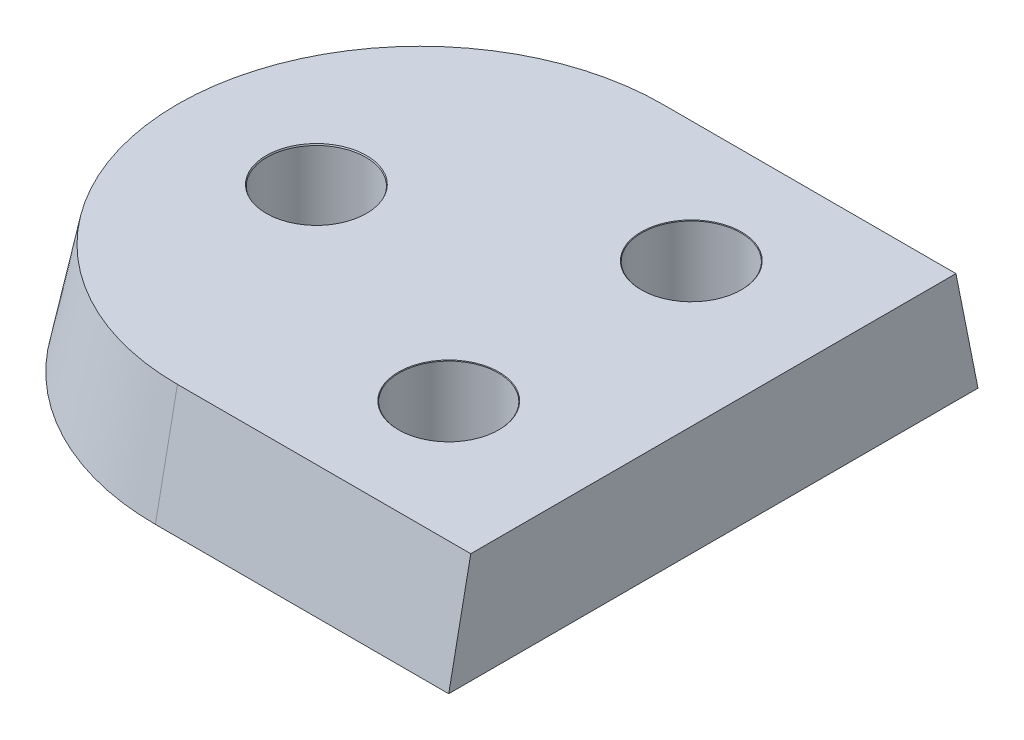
ISO-10303-21;
HEADER;
FILE_DESCRIPTION(('STEP AP214'),'2;1');
FILE_NAME('part.step','',(''),(''),'','','');
FILE_SCHEMA(('AUTOMOTIVE_DESIGN { 1 0 10303 214 1 1 1 1 }'));
ENDSEC;
DATA;
#1=APPLICATION_CONTEXT('core data for automotive mechanical design processes');
#2=APPLICATION_PROTOCOL_DEFINITION('international standard','automotive_design',2000,#1);
#3=PRODUCT_CONTEXT('',#1,'mechanical');
#4=PRODUCT('Part','Part','',(#3));
#5=PRODUCT_RELATED_PRODUCT_CATEGORY('part','',(#4));
#6=PRODUCT_DEFINITION_FORMATION('','',#4);
#7=PRODUCT_DEFINITION_CONTEXT('part definition',#1,'design');
#8=PRODUCT_DEFINITION('design','',#6,#7);
#9=PRODUCT_DEFINITION_SHAPE('','',#8);
#10=(LENGTH_UNIT() NAMED_UNIT(*) SI_UNIT(.MILLI.,.METRE.));
#11=(NAMED_UNIT(*) PLANE_ANGLE_UNIT() SI_UNIT($,.RADIAN.));
#12=(NAMED_UNIT(*) SI_UNIT($,.STERADIAN.) SOLID_ANGLE_UNIT());
#13=UNCERTAINTY_MEASURE_WITH_UNIT(LENGTH_MEASURE(1.E-05),#10,'distance_accuracy_value','');
#14=(GEOMETRIC_REPRESENTATION_CONTEXT(3) GLOBAL_UNCERTAINTY_ASSIGNED_CONTEXT((#13)) GLOBAL_UNIT_ASSIGNED_CONTEXT((#10,
#11,#12)) REPRESENTATION_CONTEXT('',''));
#15=CARTESIAN_POINT('',(0.,0.,0.));
#16=DIRECTION('',(0.,0.,1.));
#17=DIRECTION('',(1.,0.,0.));
#18=AXIS2_PLACEMENT_3D('',#15,#16,#17);
#19=CARTESIAN_POINT('',(13.3,5.,-12.));
#20=DIRECTION('',(-1.,0.,0.));
#21=DIRECTION('',(0.,0.,1.));
#22=AXIS2_PLACEMENT_3D('',#19,#20,#21);
#23=PLANE('',#22);
#24=DIRECTION('',(0.,0.,-1.));
#25=VECTOR('',#24,1.);
#26=CARTESIAN_POINT('',(13.3,0.,-12.));
#27=LINE('',#26,#25);
#28=CARTESIAN_POINT('',(13.3,0.,12.));
#29=VERTEX_POINT('',#28);
#30=CARTESIAN_POINT('',(13.3,0.,-12.));
#31=VERTEX_POINT('',#30);
#32=EDGE_CURVE('E114',#29,#31,#27,.T.);
#33=ORIENTED_EDGE('',*,*,#32,.T.);
#34=DIRECTION('',(0.,0.980580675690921,0.19611613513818));
#35=VECTOR('',#34,1.);
#36=CARTESIAN_POINT('',(13.3,5.,-11.));
#37=LINE('',#36,#35);
#38=CARTESIAN_POINT('',(13.3,5.,-11.));
#39=VERTEX_POINT('',#38);
#40=EDGE_CURVE('E11',#31,#39,#37,.T.);
#41=ORIENTED_EDGE('',*,*,#40,.T.);
#42=DIRECTION('',(0.,0.,-1.));
#43=VECTOR('',#42,1.);
#44=CARTESIAN_POINT('',(13.3,5.,-12.));
#45=LINE('',#44,#43);
#46=CARTESIAN_POINT('',(13.3,5.,11.));
#47=VERTEX_POINT('',#46);
#48=EDGE_CURVE('E113',#47,#39,#45,.T.);
#49=ORIENTED_EDGE('',*,*,#48,.F.);
#50=DIRECTION('',(0.,-0.980580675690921,0.19611613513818));
#51=VECTOR('',#50,1.);
#52=CARTESIAN_POINT('',(13.3,5.,11.));
#53=LINE('',#52,#51);
#54=EDGE_CURVE('E53',#47,#29,#53,.T.);
#55=ORIENTED_EDGE('',*,*,#54,.T.);
#56=EDGE_LOOP('',(#33,#41,#49,#55));
#57=FACE_BOUND('',#56,.T.);
#58=ADVANCED_FACE('F43',(#57),#23,.F.);
#59=CARTESIAN_POINT('',(0.,5.,0.));
#60=DIRECTION('',(0.,1.,0.));
#61=DIRECTION('',(0.,0.,1.));
#62=AXIS2_PLACEMENT_3D('',#59,#60,#61);
#63=PLANE('',#62);
#64=CARTESIAN_POINT('',(-4.69999999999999,5.,0.));
#65=DIRECTION('',(0.,1.,0.));
#66=DIRECTION('',(0.,0.,1.));
#67=AXIS2_PLACEMENT_3D('',#64,#65,#66);
#68=CIRCLE('',#67,2.275);
#69=CARTESIAN_POINT('',(-4.69999999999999,5.,2.275));
#70=VERTEX_POINT('',#69);
#71=EDGE_CURVE('E139',#70,#70,#68,.T.);
#72=ORIENTED_EDGE('',*,*,#71,.F.);
#73=EDGE_LOOP('',(#72));
#74=FACE_BOUND('',#73,.T.);
#75=CARTESIAN_POINT('',(6.80000000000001,5.,-5.5));
#76=DIRECTION('',(0.,1.,0.));
#77=DIRECTION('',(0.,0.,1.));
#78=AXIS2_PLACEMENT_3D('',#75,#76,#77);
#79=CIRCLE('',#78,2.275);
#80=CARTESIAN_POINT('',(6.80000000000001,5.,-3.225));
#81=VERTEX_POINT('',#80);
#82=EDGE_CURVE('E130',#81,#81,#79,.T.);
#83=ORIENTED_EDGE('',*,*,#82,.F.);
#84=EDGE_LOOP('',(#83));
#85=FACE_BOUND('',#84,.T.);
#86=CARTESIAN_POINT('',(6.80000000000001,5.,5.5));
#87=DIRECTION('',(0.,1.,0.));
#88=DIRECTION('',(0.,0.,1.));
#89=AXIS2_PLACEMENT_3D('',#86,#87,#88);
#90=CIRCLE('',#89,2.275);
#91=CARTESIAN_POINT('',(6.80000000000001,5.,7.775));
#92=VERTEX_POINT('',#91);
#93=EDGE_CURVE('E121',#92,#92,#90,.T.);
#94=ORIENTED_EDGE('',*,*,#93,.F.);
#95=EDGE_LOOP('',(#94));
#96=FACE_BOUND('',#95,.T.);
#97=ORIENTED_EDGE('',*,*,#48,.T.);
#98=DIRECTION('',(-1.,0.,0.));
#99=VECTOR('',#98,1.);
#100=CARTESIAN_POINT('',(0.,5.,-11.));
#101=LINE('',#100,#99);
#102=CARTESIAN_POINT('',(0.,5.,-11.));
#103=VERTEX_POINT('',#102);
#104=EDGE_CURVE('E108',#39,#103,#101,.T.);
#105=ORIENTED_EDGE('',*,*,#104,.T.);
#106=CARTESIAN_POINT('',(0.,5.,0.));
#107=DIRECTION('',(0.,1.,0.));
#108=DIRECTION('',(0.,0.,1.));
#109=AXIS2_PLACEMENT_3D('',#106,#107,#108);
#110=CIRCLE('',#109,11.);
#111=CARTESIAN_POINT('',(0.,5.,11.));
#112=VERTEX_POINT('',#111);
#113=EDGE_CURVE('E61',#103,#112,#110,.T.);
#114=ORIENTED_EDGE('',*,*,#113,.T.);
#115=DIRECTION('',(1.,0.,0.));
#116=VECTOR('',#115,1.);
#117=CARTESIAN_POINT('',(13.3,5.,11.));
#118=LINE('',#117,#116);
#119=EDGE_CURVE('E110',#112,#47,#118,.T.);
#120=ORIENTED_EDGE('',*,*,#119,.T.);
#121=EDGE_LOOP('',(#97,#105,#114,#120));
#122=FACE_BOUND('',#121,.T.);
#123=ADVANCED_FACE('F145',(#74,#85,#96,#122),#63,.T.);
#124=CARTESIAN_POINT('',(0.,0.,0.));
#125=DIRECTION('',(0.,1.,0.));
#126=DIRECTION('',(0.,0.,1.));
#127=AXIS2_PLACEMENT_3D('',#124,#125,#126);
#128=PLANE('',#127);
#129=CARTESIAN_POINT('',(-4.69999999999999,0.,0.));
#130=DIRECTION('',(0.,1.,0.));
#131=DIRECTION('',(0.,0.,1.));
#132=AXIS2_PLACEMENT_3D('',#129,#130,#131);
#133=CIRCLE('',#132,2.25);
#134=CARTESIAN_POINT('',(-4.69999999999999,0.,2.25));
#135=VERTEX_POINT('',#134);
#136=EDGE_CURVE('E133',#135,#135,#133,.T.);
#137=ORIENTED_EDGE('',*,*,#136,.T.);
#138=EDGE_LOOP('',(#137));
#139=FACE_BOUND('',#138,.T.);
#140=CARTESIAN_POINT('',(6.80000000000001,0.,-5.5));
#141=DIRECTION('',(0.,1.,0.));
#142=DIRECTION('',(0.,0.,1.));
#143=AXIS2_PLACEMENT_3D('',#140,#141,#142);
#144=CIRCLE('',#143,2.25);
#145=CARTESIAN_POINT('',(6.80000000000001,0.,-3.25));
#146=VERTEX_POINT('',#145);
#147=EDGE_CURVE('E124',#146,#146,#144,.T.);
#148=ORIENTED_EDGE('',*,*,#147,.T.);
#149=EDGE_LOOP('',(#148));
#150=FACE_BOUND('',#149,.T.);
#151=CARTESIAN_POINT('',(6.80000000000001,0.,5.5));
#152=DIRECTION('',(0.,1.,0.));
#153=DIRECTION('',(0.,0.,1.));
#154=AXIS2_PLACEMENT_3D('',#151,#152,#153);
#155=CIRCLE('',#154,2.25);
#156=CARTESIAN_POINT('',(6.80000000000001,0.,7.75));
#157=VERTEX_POINT('',#156);
#158=EDGE_CURVE('E102',#157,#157,#155,.T.);
#159=ORIENTED_EDGE('',*,*,#158,.T.);
#160=EDGE_LOOP('',(#159));
#161=FACE_BOUND('',#160,.T.);
#162=DIRECTION('',(-1.,0.,0.));
#163=VECTOR('',#162,1.);
#164=CARTESIAN_POINT('',(13.3,0.,-12.));
#165=LINE('',#164,#163);
#166=CARTESIAN_POINT('',(0.,0.,-12.));
#167=VERTEX_POINT('',#166);
#168=EDGE_CURVE('E91',#31,#167,#165,.T.);
#169=ORIENTED_EDGE('',*,*,#168,.F.);
#170=ORIENTED_EDGE('',*,*,#32,.F.);
#171=DIRECTION('',(1.,0.,0.));
#172=VECTOR('',#171,1.);
#173=CARTESIAN_POINT('',(13.3,0.,12.));
#174=LINE('',#173,#172);
#175=CARTESIAN_POINT('',(0.,0.,12.));
#176=VERTEX_POINT('',#175);
#177=EDGE_CURVE('E94',#176,#29,#174,.T.);
#178=ORIENTED_EDGE('',*,*,#177,.F.);
#179=CARTESIAN_POINT('',(0.,0.,0.));
#180=DIRECTION('',(0.,1.,0.));
#181=DIRECTION('',(0.,0.,1.));
#182=AXIS2_PLACEMENT_3D('',#179,#180,#181);
#183=CIRCLE('',#182,12.);
#184=EDGE_CURVE('E88',#167,#176,#183,.T.);
#185=ORIENTED_EDGE('',*,*,#184,.F.);
#186=EDGE_LOOP('',(#169,#170,#178,#185));
#187=FACE_BOUND('',#186,.T.);
#188=ADVANCED_FACE('F89',(#139,#150,#161,#187),#128,.F.);
#189=CARTESIAN_POINT('',(0.,5.,11.));
#190=DIRECTION('',(0.,0.19611613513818,0.980580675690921));
#191=DIRECTION('',(-1.,0.,0.));
#192=AXIS2_PLACEMENT_3D('',#189,#190,#191);
#193=PLANE('',#192);
#194=ORIENTED_EDGE('',*,*,#54,.F.);
#195=ORIENTED_EDGE('',*,*,#119,.F.);
#196=DIRECTION('',(0.,0.980580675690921,-0.19611613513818));
#197=VECTOR('',#196,1.);
#198=CARTESIAN_POINT('',(0.,-1.00776591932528E-13,12.));
#199=LINE('',#198,#197);
#200=EDGE_CURVE('E48',#176,#112,#199,.T.);
#201=ORIENTED_EDGE('',*,*,#200,.F.);
#202=ORIENTED_EDGE('',*,*,#177,.T.);
#203=EDGE_LOOP('',(#194,#195,#201,#202));
#204=FACE_BOUND('',#203,.T.);
#205=ADVANCED_FACE('F46',(#204),#193,.T.);
#206=CARTESIAN_POINT('',(0.,5.,0.));
#207=DIRECTION('',(0.,-1.,0.));
#208=DIRECTION('',(0.,0.,-1.));
#209=AXIS2_PLACEMENT_3D('',#206,#207,#208);
#210=CONICAL_SURFACE('',#209,11.,0.197395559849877);
#211=ORIENTED_EDGE('',*,*,#200,.T.);
#212=ORIENTED_EDGE('',*,*,#113,.F.);
#213=DIRECTION('',(0.,0.980580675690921,0.19611613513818));
#214=VECTOR('',#213,1.);
#215=CARTESIAN_POINT('',(0.,-1.01080381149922E-13,-12.));
#216=LINE('',#215,#214);
#217=EDGE_CURVE('E69',#167,#103,#216,.T.);
#218=ORIENTED_EDGE('',*,*,#217,.F.);
#219=ORIENTED_EDGE('',*,*,#184,.T.);
#220=EDGE_LOOP('',(#211,#212,#218,#219));
#221=FACE_BOUND('',#220,.T.);
#222=ADVANCED_FACE('F101',(#221),#210,.T.);
#223=CARTESIAN_POINT('',(0.,5.,-11.));
#224=DIRECTION('',(0.,0.19611613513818,-0.980580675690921));
#225=DIRECTION('',(1.,0.,0.));
#226=AXIS2_PLACEMENT_3D('',#223,#224,#225);
#227=PLANE('',#226);
#228=ORIENTED_EDGE('',*,*,#40,.F.);
#229=ORIENTED_EDGE('',*,*,#168,.T.);
#230=ORIENTED_EDGE('',*,*,#217,.T.);
#231=ORIENTED_EDGE('',*,*,#104,.F.);
#232=EDGE_LOOP('',(#228,#229,#230,#231));
#233=FACE_BOUND('',#232,.T.);
#234=ADVANCED_FACE('F99',(#233),#227,.T.);
#235=CARTESIAN_POINT('',(6.80000000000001,5.,5.5));
#236=DIRECTION('',(0.,1.,0.));
#237=DIRECTION('',(0.,0.,1.));
#238=AXIS2_PLACEMENT_3D('',#235,#236,#237);
#239=CYLINDRICAL_SURFACE('',#238,2.25);
#240=ORIENTED_EDGE('',*,*,#158,.F.);
#241=EDGE_LOOP('',(#240));
#242=FACE_BOUND('',#241,.T.);
#243=CARTESIAN_POINT('',(6.80000000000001,4.975,5.5));
#244=DIRECTION('',(0.,1.,0.));
#245=DIRECTION('',(0.,0.,1.));
#246=AXIS2_PLACEMENT_3D('',#243,#244,#245);
#247=CIRCLE('',#246,2.25);
#248=CARTESIAN_POINT('',(6.80000000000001,4.975,7.75));
#249=VERTEX_POINT('',#248);
#250=EDGE_CURVE('E104',#249,#249,#247,.T.);
#251=ORIENTED_EDGE('',*,*,#250,.T.);
#252=EDGE_LOOP('',(#251));
#253=FACE_BOUND('',#252,.T.);
#254=ADVANCED_FACE('F173',(#242,#253),#239,.F.);
#255=CARTESIAN_POINT('',(6.80000000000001,5.,5.5));
#256=DIRECTION('',(0.,1.,0.));
#257=DIRECTION('',(0.,0.,1.));
#258=AXIS2_PLACEMENT_3D('',#255,#256,#257);
#259=CONICAL_SURFACE('',#258,2.275,0.785398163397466);
#260=ORIENTED_EDGE('',*,*,#250,.F.);
#261=EDGE_LOOP('',(#260));
#262=FACE_BOUND('',#261,.T.);
#263=ORIENTED_EDGE('',*,*,#93,.T.);
#264=EDGE_LOOP('',(#263));
#265=FACE_BOUND('',#264,.T.);
#266=ADVANCED_FACE('F181',(#262,#265),#259,.F.);
#267=CARTESIAN_POINT('',(6.80000000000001,5.,-5.5));
#268=DIRECTION('',(0.,1.,0.));
#269=DIRECTION('',(0.,0.,1.));
#270=AXIS2_PLACEMENT_3D('',#267,#268,#269);
#271=CYLINDRICAL_SURFACE('',#270,2.25);
#272=ORIENTED_EDGE('',*,*,#147,.F.);
#273=EDGE_LOOP('',(#272));
#274=FACE_BOUND('',#273,.T.);
#275=CARTESIAN_POINT('',(6.80000000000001,4.975,-5.5));
#276=DIRECTION('',(0.,1.,0.));
#277=DIRECTION('',(0.,0.,1.));
#278=AXIS2_PLACEMENT_3D('',#275,#276,#277);
#279=CIRCLE('',#278,2.25);
#280=CARTESIAN_POINT('',(6.80000000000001,4.975,-3.25));
#281=VERTEX_POINT('',#280);
#282=EDGE_CURVE('E127',#281,#281,#279,.T.);
#283=ORIENTED_EDGE('',*,*,#282,.T.);
#284=EDGE_LOOP('',(#283));
#285=FACE_BOUND('',#284,.T.);
#286=ADVANCED_FACE('F187',(#274,#285),#271,.F.);
#287=CARTESIAN_POINT('',(6.80000000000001,5.,-5.5));
#288=DIRECTION('',(0.,1.,0.));
#289=DIRECTION('',(0.,0.,1.));
#290=AXIS2_PLACEMENT_3D('',#287,#288,#289);
#291=CONICAL_SURFACE('',#290,2.275,0.785398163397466);
#292=ORIENTED_EDGE('',*,*,#282,.F.);
#293=EDGE_LOOP('',(#292));
#294=FACE_BOUND('',#293,.T.);
#295=ORIENTED_EDGE('',*,*,#82,.T.);
#296=EDGE_LOOP('',(#295));
#297=FACE_BOUND('',#296,.T.);
#298=ADVANCED_FACE('F195',(#294,#297),#291,.F.);
#299=CARTESIAN_POINT('',(-4.69999999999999,5.,0.));
#300=DIRECTION('',(0.,1.,0.));
#301=DIRECTION('',(0.,0.,1.));
#302=AXIS2_PLACEMENT_3D('',#299,#300,#301);
#303=CYLINDRICAL_SURFACE('',#302,2.25);
#304=ORIENTED_EDGE('',*,*,#136,.F.);
#305=EDGE_LOOP('',(#304));
#306=FACE_BOUND('',#305,.T.);
#307=CARTESIAN_POINT('',(-4.69999999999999,4.93964466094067,0.));
#308=DIRECTION('',(0.,1.,0.));
#309=DIRECTION('',(0.,0.,1.));
#310=AXIS2_PLACEMENT_3D('',#307,#308,#309);
#311=CIRCLE('',#310,2.25);
#312=CARTESIAN_POINT('',(-4.69999999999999,4.93964466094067,2.25));
#313=VERTEX_POINT('',#312);
#314=EDGE_CURVE('E136',#313,#313,#311,.T.);
#315=ORIENTED_EDGE('',*,*,#314,.T.);
#316=EDGE_LOOP('',(#315));
#317=FACE_BOUND('',#316,.T.);
#318=ADVANCED_FACE('F199',(#306,#317),#303,.F.);
#319=CARTESIAN_POINT('',(-4.69999999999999,5.,0.));
#320=DIRECTION('',(0.,1.,0.));
#321=DIRECTION('',(0.,0.,1.));
#322=AXIS2_PLACEMENT_3D('',#319,#320,#321);
#323=CONICAL_SURFACE('',#322,2.275,0.392699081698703);
#324=ORIENTED_EDGE('',*,*,#314,.F.);
#325=EDGE_LOOP('',(#324));
#326=FACE_BOUND('',#325,.T.);
#327=ORIENTED_EDGE('',*,*,#71,.T.);
#328=EDGE_LOOP('',(#327));
#329=FACE_BOUND('',#328,.T.);
#330=ADVANCED_FACE('F143',(#326,#329),#323,.F.);
#331=CLOSED_SHELL('',(#58,#123,#188,#205,#222,#234,#254,#266,#286,#298,#318,#330));
#332=MANIFOLD_SOLID_BREP('B2',#331);
#333=ADVANCED_BREP_SHAPE_REPRESENTATION('',(#18,#332),#14);
#334=SHAPE_DEFINITION_REPRESENTATION(#9,#333);
ENDSEC;
END-ISO-10303-21;
